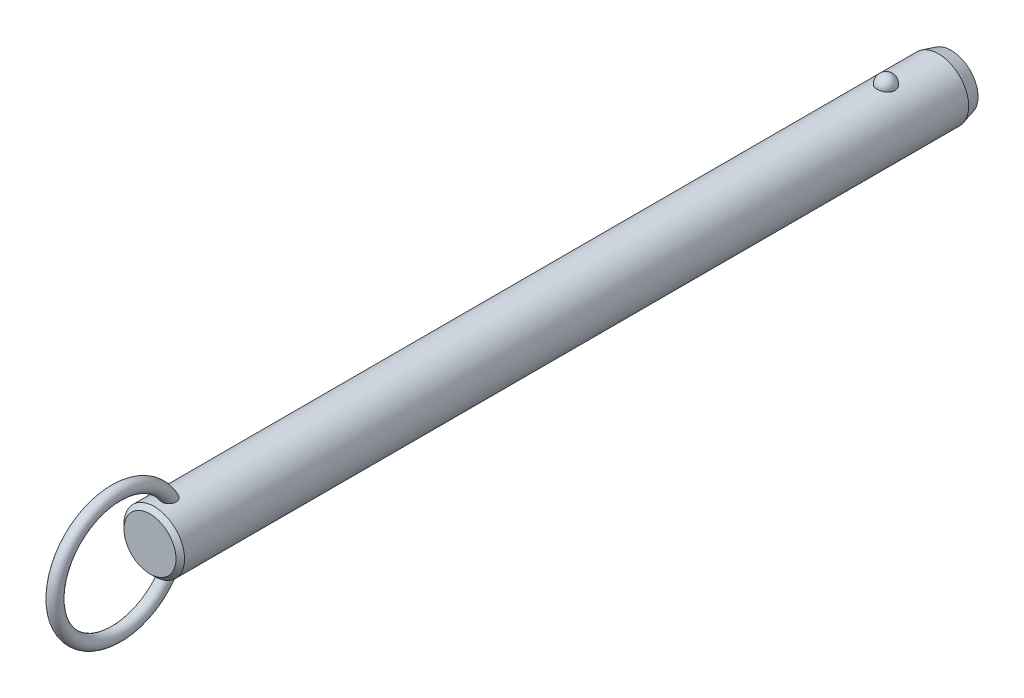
ISO-10303-21;
HEADER;
FILE_DESCRIPTION(('STEP AP214'),'2;1');
FILE_NAME('part.step','',(''),(''),'','','');
FILE_SCHEMA(('AUTOMOTIVE_DESIGN { 1 0 10303 214 1 1 1 1 }'));
ENDSEC;
DATA;
#1=APPLICATION_CONTEXT('core data for automotive mechanical design processes');
#2=APPLICATION_PROTOCOL_DEFINITION('international standard','automotive_design',2000,#1);
#3=PRODUCT_CONTEXT('',#1,'mechanical');
#4=PRODUCT('Part','Part','',(#3));
#5=PRODUCT_RELATED_PRODUCT_CATEGORY('part','',(#4));
#6=PRODUCT_DEFINITION_FORMATION('','',#4);
#7=PRODUCT_DEFINITION_CONTEXT('part definition',#1,'design');
#8=PRODUCT_DEFINITION('design','',#6,#7);
#9=PRODUCT_DEFINITION_SHAPE('','',#8);
#10=(LENGTH_UNIT() NAMED_UNIT(*) SI_UNIT(.MILLI.,.METRE.));
#11=(NAMED_UNIT(*) PLANE_ANGLE_UNIT() SI_UNIT($,.RADIAN.));
#12=(NAMED_UNIT(*) SI_UNIT($,.STERADIAN.) SOLID_ANGLE_UNIT());
#13=UNCERTAINTY_MEASURE_WITH_UNIT(LENGTH_MEASURE(1.E-05),#10,'distance_accuracy_value','');
#14=(GEOMETRIC_REPRESENTATION_CONTEXT(3) GLOBAL_UNCERTAINTY_ASSIGNED_CONTEXT((#13)) GLOBAL_UNIT_ASSIGNED_CONTEXT((#10,
#11,#12)) REPRESENTATION_CONTEXT('',''));
#15=CARTESIAN_POINT('',(0.,0.,0.));
#16=DIRECTION('',(0.,0.,1.));
#17=DIRECTION('',(1.,0.,0.));
#18=AXIS2_PLACEMENT_3D('',#15,#16,#17);
#19=CARTESIAN_POINT('',(0.,0.,162.6));
#20=DIRECTION('',(0.,0.,-1.));
#21=DIRECTION('',(-1.,0.,0.));
#22=AXIS2_PLACEMENT_3D('',#19,#20,#21);
#23=CYLINDRICAL_SURFACE('',#22,7.1);
#24=CARTESIAN_POINT('',(2.0769088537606,6.78943661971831,-2.1));
#25=CARTESIAN_POINT('',(2.07690739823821,6.78943796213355,-1.98268154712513));
#26=CARTESIAN_POINT('',(2.06738130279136,6.79237331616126,-1.86534506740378));
#27=CARTESIAN_POINT('',(2.0295040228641,6.8037853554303,-1.63400788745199));
#28=CARTESIAN_POINT('',(2.00114757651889,6.81226358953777,-1.52000812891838));
#29=CARTESIAN_POINT('',(1.92632025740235,6.83379798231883,-1.29863433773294));
#30=CARTESIAN_POINT('',(1.87985726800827,6.84685214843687,-1.19125744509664));
#31=CARTESIAN_POINT('',(1.76995205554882,6.87608091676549,-0.98604657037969));
#32=CARTESIAN_POINT('',(1.70650980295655,6.8922555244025,-0.88821260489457));
#33=CARTESIAN_POINT('',(1.5638119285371,6.92602930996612,-0.704242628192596));
#34=CARTESIAN_POINT('',(1.4844714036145,6.94363582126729,-0.618173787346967));
#35=CARTESIAN_POINT('',(1.31221746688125,6.97823658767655,-0.460740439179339));
#36=CARTESIAN_POINT('',(1.21930409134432,6.99523084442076,-0.389375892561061));
#37=CARTESIAN_POINT('',(1.02268781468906,7.02666176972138,-0.263547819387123));
#38=CARTESIAN_POINT('',(0.91902009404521,7.04110638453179,-0.209031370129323));
#39=CARTESIAN_POINT('',(0.703548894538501,7.06588726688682,-0.118163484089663));
#40=CARTESIAN_POINT('',(0.591746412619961,7.07622403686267,-0.0818098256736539));
#41=CARTESIAN_POINT('',(0.365557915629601,7.09147068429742,-0.0288711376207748));
#42=CARTESIAN_POINT('',(0.251267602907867,7.09648447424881,-0.0119070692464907));
#43=CARTESIAN_POINT('',(0.0213499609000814,7.10089837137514,0.00304925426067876));
#44=CARTESIAN_POINT('',(-0.0942772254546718,7.10029907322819,0.00104351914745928));
#45=CARTESIAN_POINT('',(-0.321651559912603,7.09360829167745,-0.0216931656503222));
#46=CARTESIAN_POINT('',(-0.433431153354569,7.08760388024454,-0.0421272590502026));
#47=CARTESIAN_POINT('',(-0.651862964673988,7.07086131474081,-0.100729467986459));
#48=CARTESIAN_POINT('',(-0.758515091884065,7.06012307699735,-0.138897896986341));
#49=CARTESIAN_POINT('',(-0.964449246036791,7.03496097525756,-0.232213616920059));
#50=CARTESIAN_POINT('',(-1.06368095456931,7.02051445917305,-0.287465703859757));
#51=CARTESIAN_POINT('',(-1.25145353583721,6.98948740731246,-0.413383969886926));
#52=CARTESIAN_POINT('',(-1.33999321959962,6.97290663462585,-0.48405186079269));
#53=CARTESIAN_POINT('',(-1.50591604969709,6.93898770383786,-0.640594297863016));
#54=CARTESIAN_POINT('',(-1.58302488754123,6.92164094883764,-0.726757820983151));
#55=CARTESIAN_POINT('',(-1.72189320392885,6.8884103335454,-0.91092752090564));
#56=CARTESIAN_POINT('',(-1.78365144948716,6.87252659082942,-1.008934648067));
#57=CARTESIAN_POINT('',(-1.89101272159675,6.84377189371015,-1.21549497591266));
#58=CARTESIAN_POINT('',(-1.93639553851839,6.83094274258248,-1.32416860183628));
#59=CARTESIAN_POINT('',(-2.00874275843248,6.81002070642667,-1.54791500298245));
#60=CARTESIAN_POINT('',(-2.03570774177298,6.80192767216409,-1.66298757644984));
#61=CARTESIAN_POINT('',(-2.07047276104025,6.7914266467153,-1.89571453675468));
#62=CARTESIAN_POINT('',(-2.07835878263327,6.78899315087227,-2.01335491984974));
#63=CARTESIAN_POINT('',(-2.07502083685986,6.79001409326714,-2.24833570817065));
#64=CARTESIAN_POINT('',(-2.06379746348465,6.7934683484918,-2.36567612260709));
#65=CARTESIAN_POINT('',(-2.02263913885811,6.80583442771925,-2.59603194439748));
#66=CARTESIAN_POINT('',(-1.99281127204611,6.81471501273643,-2.70906820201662));
#67=CARTESIAN_POINT('',(-1.91526639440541,6.83691232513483,-2.92836575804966));
#68=CARTESIAN_POINT('',(-1.8675486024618,6.85022924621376,-3.03462676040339));
#69=CARTESIAN_POINT('',(-1.75504492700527,6.87991336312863,-3.23806487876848));
#70=CARTESIAN_POINT('',(-1.69015924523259,6.89629822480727,-3.33518422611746));
#71=CARTESIAN_POINT('',(-1.54505404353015,6.93024852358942,-3.51697105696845));
#72=CARTESIAN_POINT('',(-1.46483385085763,6.94781401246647,-3.60163799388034));
#73=CARTESIAN_POINT('',(-1.29071406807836,6.98225977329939,-3.75654119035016));
#74=CARTESIAN_POINT('',(-1.19675650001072,6.99913673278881,-3.82671308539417));
#75=CARTESIAN_POINT('',(-0.997940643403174,7.03023618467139,-3.9501837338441));
#76=CARTESIAN_POINT('',(-0.89308318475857,7.04445887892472,-4.00348377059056));
#77=CARTESIAN_POINT('',(-0.676902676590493,7.06848365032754,-4.09107242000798));
#78=CARTESIAN_POINT('',(-0.565686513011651,7.0783430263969,-4.12560889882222));
#79=CARTESIAN_POINT('',(-0.338739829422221,7.09282534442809,-4.17575450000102));
#80=CARTESIAN_POINT('',(-0.223009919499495,7.09744899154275,-4.19136617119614));
#81=CARTESIAN_POINT('',(0.00707628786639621,7.10090930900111,-4.20307965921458));
#82=CARTESIAN_POINT('',(0.121410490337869,7.09986531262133,-4.19958377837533));
#83=CARTESIAN_POINT('',(0.347815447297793,7.092380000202,-4.17411564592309));
#84=CARTESIAN_POINT('',(0.459886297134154,7.08593891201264,-4.15214417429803));
#85=CARTESIAN_POINT('',(0.678084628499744,7.06838983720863,-4.09049562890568));
#86=CARTESIAN_POINT('',(0.784237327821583,7.05730369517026,-4.05090137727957));
#87=CARTESIAN_POINT('',(0.988305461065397,7.03163139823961,-3.95511447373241));
#88=CARTESIAN_POINT('',(1.08622031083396,7.01704499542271,-3.89892064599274));
#89=CARTESIAN_POINT('',(1.27284490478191,6.98562668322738,-3.77035541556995));
#90=CARTESIAN_POINT('',(1.36137372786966,6.96876135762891,-3.69772964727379));
#91=CARTESIAN_POINT('',(1.52509486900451,6.93477412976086,-3.53878279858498));
#92=CARTESIAN_POINT('',(1.60028496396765,6.91765218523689,-3.45245943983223));
#93=CARTESIAN_POINT('',(1.73681688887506,6.88465753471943,-3.26658774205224));
#94=CARTESIAN_POINT('',(1.79785966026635,6.86881574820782,-3.16681408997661));
#95=CARTESIAN_POINT('',(1.90265327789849,6.84053157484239,-2.95814408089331));
#96=CARTESIAN_POINT('',(1.94640861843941,6.82808830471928,-2.84925010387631));
#97=CARTESIAN_POINT('',(2.01274378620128,6.80881460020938,-2.63454318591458));
#98=CARTESIAN_POINT('',(2.03676193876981,6.80160856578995,-2.52920574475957));
#99=CARTESIAN_POINT('',(2.06884490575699,6.79191902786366,-2.3159172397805));
#100=CARTESIAN_POINT('',(2.07691019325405,6.78943538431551,-2.20796625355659));
#101=CARTESIAN_POINT('',(2.0769088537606,6.78943661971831,-2.1));
#102=B_SPLINE_CURVE_WITH_KNOTS('',3,(#24,#25,#26,#27,#28,#29,#30,#31,#32,#33,#34,#35,#36,#37,
#38,#39,#40,#41,#42,#43,#44,#45,#46,#47,#48,#49,#50,#51,#52,#53,#54,#55,#56,#57,#58,#59,#60,#61,
#62,#63,#64,#65,#66,#67,#68,#69,#70,#71,#72,#73,#74,#75,#76,#77,#78,#79,#80,#81,#82,#83,#84,#85,
#86,#87,#88,#89,#90,#91,#92,#93,#94,#95,#96,#97,#98,#99,#100,#101),.UNSPECIFIED.,.T.,.F.,(4,2,2,
2,2,2,2,2,2,2,2,2,2,2,2,2,2,2,2,2,2,2,2,2,2,2,2,2,2,2,2,2,2,2,2,2,2,2,4),(0.,0.351568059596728,
0.703234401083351,1.05474780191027,1.40626181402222,1.75970563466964,2.11314851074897,
2.4654696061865,2.81774759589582,3.16301449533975,3.50824481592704,3.84801136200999,
4.18778391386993,4.52968352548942,4.87162112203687,5.22076181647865,5.56993054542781,
5.92363364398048,6.27732559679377,6.62942052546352,6.98150450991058,7.33158042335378,
7.68167162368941,8.03384443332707,8.38603269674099,8.73975272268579,9.09344583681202,
9.44234545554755,9.79119807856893,10.1327344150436,10.4742563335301,10.8141898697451,
11.1541474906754,11.4997793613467,11.8454687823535,12.1979079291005,12.5502553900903,
12.8738073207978,13.1973496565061),.UNSPECIFIED.);
#103=CARTESIAN_POINT('',(2.0769088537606,6.78943661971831,-2.1));
#104=VERTEX_POINT('',#103);
#105=EDGE_CURVE('E41',#104,#104,#102,.T.);
#106=ORIENTED_EDGE('',*,*,#105,.T.);
#107=EDGE_LOOP('',(#106));
#108=FACE_BOUND('',#107,.T.);
#109=CARTESIAN_POINT('',(0.,0.,169.52));
#110=DIRECTION('',(0.,0.,1.));
#111=DIRECTION('',(1.,0.,0.));
#112=AXIS2_PLACEMENT_3D('',#109,#110,#111);
#113=CIRCLE('',#112,7.1);
#114=CARTESIAN_POINT('',(7.1,0.,169.52));
#115=VERTEX_POINT('',#114);
#116=EDGE_CURVE('E10',#115,#115,#113,.F.);
#117=ORIENTED_EDGE('',*,*,#116,.T.);
#118=EDGE_LOOP('',(#117));
#119=FACE_BOUND('',#118,.T.);
#120=CARTESIAN_POINT('',(-0.429539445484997,-7.08699541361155,164.342921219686));
#121=CARTESIAN_POINT('',(-0.508331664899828,-7.08221999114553,164.366876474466));
#122=CARTESIAN_POINT('',(-0.585039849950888,-7.07624016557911,164.397457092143));
#123=CARTESIAN_POINT('',(-0.73208265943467,-7.06254296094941,164.471024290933));
#124=CARTESIAN_POINT('',(-0.802417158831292,-7.05482554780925,164.514011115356));
#125=CARTESIAN_POINT('',(-0.934722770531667,-7.03851844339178,164.611113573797));
#126=CARTESIAN_POINT('',(-0.996700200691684,-7.02992941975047,164.665220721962));
#127=CARTESIAN_POINT('',(-1.11079942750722,-7.01280697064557,164.782967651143));
#128=CARTESIAN_POINT('',(-1.16292136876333,-7.00427354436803,164.846607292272));
#129=CARTESIAN_POINT('',(-1.25705660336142,-6.98799959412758,164.982687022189));
#130=CARTESIAN_POINT('',(-1.29888032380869,-6.98027525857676,165.055259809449));
#131=CARTESIAN_POINT('',(-1.37069920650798,-6.96652886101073,165.206168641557));
#132=CARTESIAN_POINT('',(-1.40069157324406,-6.96050720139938,165.284506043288));
#133=CARTESIAN_POINT('',(-1.45043507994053,-6.95031881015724,165.450190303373));
#134=CARTESIAN_POINT('',(-1.46937115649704,-6.94630231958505,165.537789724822));
#135=CARTESIAN_POINT('',(-1.49424917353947,-6.94099239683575,165.714871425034));
#136=CARTESIAN_POINT('',(-1.50018601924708,-6.93970003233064,165.804354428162));
#137=CARTESIAN_POINT('',(-1.49978214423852,-6.93978815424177,165.994060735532));
#138=CARTESIAN_POINT('',(-1.49187639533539,-6.94150934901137,166.094279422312));
#139=CARTESIAN_POINT('',(-1.46177925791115,-6.94790814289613,166.292479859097));
#140=CARTESIAN_POINT('',(-1.43957541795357,-6.95258831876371,166.390459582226));
#141=CARTESIAN_POINT('',(-1.37783293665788,-6.96510647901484,166.59536292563));
#142=CARTESIAN_POINT('',(-1.33634073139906,-6.97328848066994,166.701680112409));
#143=CARTESIAN_POINT('',(-1.23686994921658,-6.99161706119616,166.906177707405));
#144=CARTESIAN_POINT('',(-1.17889192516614,-7.00176357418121,167.004358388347));
#145=CARTESIAN_POINT('',(-1.05875124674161,-7.02082898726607,167.172374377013));
#146=CARTESIAN_POINT('',(-0.999247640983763,-7.02963746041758,167.244123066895));
#147=CARTESIAN_POINT('',(-0.869494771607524,-7.04686074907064,167.377195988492));
#148=CARTESIAN_POINT('',(-0.799263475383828,-7.05527619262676,167.438537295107));
#149=CARTESIAN_POINT('',(-0.665408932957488,-7.06899457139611,167.535131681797));
#150=CARTESIAN_POINT('',(-0.603817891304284,-7.07457275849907,167.573151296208));
#151=CARTESIAN_POINT('',(-0.475172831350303,-7.08437420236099,167.638758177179));
#152=CARTESIAN_POINT('',(-0.408123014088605,-7.08859848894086,167.666353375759));
#153=CARTESIAN_POINT('',(-0.269431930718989,-7.09522749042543,167.709256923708));
#154=CARTESIAN_POINT('',(-0.197757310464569,-7.09761688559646,167.724461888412));
#155=CARTESIAN_POINT('',(-0.0527849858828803,-7.10017268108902,167.740716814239));
#156=CARTESIAN_POINT('',(0.0205115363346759,-7.10034065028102,167.741776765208));
#157=CARTESIAN_POINT('',(0.156426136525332,-7.09855986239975,167.730461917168));
#158=CARTESIAN_POINT('',(0.219199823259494,-7.09688191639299,167.719806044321));
#159=CARTESIAN_POINT('',(0.342134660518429,-7.09201880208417,167.688537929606));
#160=CARTESIAN_POINT('',(0.402295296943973,-7.08883333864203,167.667923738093));
#161=CARTESIAN_POINT('',(0.520687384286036,-7.08113868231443,167.617212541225));
#162=CARTESIAN_POINT('',(0.578791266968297,-7.07658958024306,167.586827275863));
#163=CARTESIAN_POINT('',(0.690173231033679,-7.06659708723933,167.518367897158));
#164=CARTESIAN_POINT('',(0.743447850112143,-7.061153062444,167.480288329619));
#165=CARTESIAN_POINT('',(0.870947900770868,-7.04680292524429,167.376592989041));
#166=CARTESIAN_POINT('',(0.941828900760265,-7.03755800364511,167.306897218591));
#167=CARTESIAN_POINT('',(1.07136606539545,-7.01900793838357,167.156945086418));
#168=CARTESIAN_POINT('',(1.13000013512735,-7.00970271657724,167.076670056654));
#169=CARTESIAN_POINT('',(1.23579584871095,-6.99183327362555,166.906899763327));
#170=CARTESIAN_POINT('',(1.28274271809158,-6.98328455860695,166.817269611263));
#171=CARTESIAN_POINT('',(1.36351442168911,-6.96796352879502,166.632176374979));
#172=CARTESIAN_POINT('',(1.39733971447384,-6.96119115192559,166.536713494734));
#173=CARTESIAN_POINT('',(1.45579181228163,-6.94922464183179,166.32530928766));
#174=CARTESIAN_POINT('',(1.47790145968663,-6.94449000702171,166.208631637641));
#175=CARTESIAN_POINT('',(1.50168752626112,-6.93938731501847,165.973015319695));
#176=CARTESIAN_POINT('',(1.50336085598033,-6.93901991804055,165.85407631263));
#177=CARTESIAN_POINT('',(1.48486516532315,-6.9430010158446,165.62360799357));
#178=CARTESIAN_POINT('',(1.46573441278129,-6.9471253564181,165.511995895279));
#179=CARTESIAN_POINT('',(1.40606892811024,-6.95944667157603,165.294886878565));
#180=CARTESIAN_POINT('',(1.36556446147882,-6.96763788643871,165.1893815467));
#181=CARTESIAN_POINT('',(1.2708270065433,-6.98548038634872,165.004287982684));
#182=CARTESIAN_POINT('',(1.21949810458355,-6.99473841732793,164.923171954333));
#183=CARTESIAN_POINT('',(1.10242050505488,-7.01414069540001,164.772227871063));
#184=CARTESIAN_POINT('',(1.03668119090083,-7.02428436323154,164.70239252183));
#185=CARTESIAN_POINT('',(0.900559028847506,-7.04295285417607,164.583573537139));
#186=CARTESIAN_POINT('',(0.831428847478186,-7.05153466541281,164.533157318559));
#187=CARTESIAN_POINT('',(0.685291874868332,-7.06723150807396,164.445142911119));
#188=CARTESIAN_POINT('',(0.608287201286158,-7.07434693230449,164.407541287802));
#189=CARTESIAN_POINT('',(0.451878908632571,-7.08602232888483,164.347491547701));
#190=CARTESIAN_POINT('',(0.372686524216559,-7.09067127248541,164.324508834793));
#191=CARTESIAN_POINT('',(0.21147739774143,-7.09730788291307,164.292035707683));
#192=CARTESIAN_POINT('',(0.129460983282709,-7.09929585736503,164.28254373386));
#193=CARTESIAN_POINT('',(-0.0332905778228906,-7.10037858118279,164.277351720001));
#194=CARTESIAN_POINT('',(-0.114016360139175,-7.09953334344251,164.281365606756));
#195=CARTESIAN_POINT('',(-0.273670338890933,-7.09517338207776,164.302454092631));
#196=CARTESIAN_POINT('',(-0.352598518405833,-7.09165863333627,164.319528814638));
#197=CARTESIAN_POINT('',(-0.429539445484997,-7.08699541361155,164.342921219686));
#198=B_SPLINE_CURVE_WITH_KNOTS('',3,(#120,#121,#122,#123,#124,#125,#126,#127,#128,#129,#130,
#131,#132,#133,#134,#135,#136,#137,#138,#139,#140,#141,#142,#143,#144,#145,#146,#147,#148,#149,
#150,#151,#152,#153,#154,#155,#156,#157,#158,#159,#160,#161,#162,#163,#164,#165,#166,#167,#168,
#169,#170,#171,#172,#173,#174,#175,#176,#177,#178,#179,#180,#181,#182,#183,#184,#185,#186,#187,
#188,#189,#190,#191,#192,#193,#194,#195,#196,#197),.UNSPECIFIED.,.T.,.F.,(4,2,2,2,2,2,2,2,2,2,2,
2,2,2,2,2,2,2,2,2,2,2,2,2,2,2,2,2,2,2,2,2,2,2,2,2,2,2,4),(0.,0.247183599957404,
0.494372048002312,0.741372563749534,0.988369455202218,1.23962059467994,1.490931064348,
1.75897818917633,2.02713035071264,2.3275826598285,2.62829697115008,2.97008736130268,
3.31186629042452,3.59175319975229,3.87117637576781,4.08813841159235,4.30493502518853,
4.5235225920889,4.74195577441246,4.93215328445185,5.12238804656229,5.31884850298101,
5.51544871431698,5.81332317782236,6.11173048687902,6.41527266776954,6.71880423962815,
7.07358156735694,7.42841252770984,7.76631485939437,8.10373999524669,8.39142246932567,
8.67891817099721,8.93560332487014,9.19221962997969,9.43881106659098,9.68537399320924,
9.92674752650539,10.1681233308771),.UNSPECIFIED.);
#199=CARTESIAN_POINT('',(-0.429539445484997,-7.08699541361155,164.342921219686));
#200=VERTEX_POINT('',#199);
#201=EDGE_CURVE('E59',#200,#200,#198,.T.);
#202=ORIENTED_EDGE('',*,*,#201,.T.);
#203=EDGE_LOOP('',(#202));
#204=FACE_BOUND('',#203,.T.);
#205=CARTESIAN_POINT('',(-0.429539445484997,7.08699541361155,164.342921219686));
#206=CARTESIAN_POINT('',(-0.35166550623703,7.09171429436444,164.319246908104));
#207=CARTESIAN_POINT('',(-0.271733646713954,7.09525896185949,164.302036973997));
#208=CARTESIAN_POINT('',(-0.110026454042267,7.09960839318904,164.281005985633));
#209=CARTESIAN_POINT('',(-0.0282502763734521,7.10041187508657,164.277191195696));
#210=CARTESIAN_POINT('',(0.134782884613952,7.09918849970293,164.283059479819));
#211=CARTESIAN_POINT('',(0.216039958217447,7.09716214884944,164.29274013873));
#212=CARTESIAN_POINT('',(0.375730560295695,7.09050177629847,164.325347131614));
#213=CARTESIAN_POINT('',(0.454164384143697,7.08586802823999,164.348272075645));
#214=CARTESIAN_POINT('',(0.606025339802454,7.07449911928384,164.406771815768));
#215=CARTESIAN_POINT('',(0.67945100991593,7.06776334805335,164.442350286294));
#216=CARTESIAN_POINT('',(0.819234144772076,7.05292866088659,164.525175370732));
#217=CARTESIAN_POINT('',(0.88559181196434,7.04482978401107,164.572421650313));
#218=CARTESIAN_POINT('',(1.00993211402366,7.02808709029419,164.677590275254));
#219=CARTESIAN_POINT('',(1.06785399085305,7.01943990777,164.735583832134));
#220=CARTESIAN_POINT('',(1.17342527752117,7.00256662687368,164.860301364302));
#221=CARTESIAN_POINT('',(1.22107408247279,6.99434055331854,164.927025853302));
#222=CARTESIAN_POINT('',(1.30652927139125,6.97889183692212,165.069362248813));
#223=CARTESIAN_POINT('',(1.34399711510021,6.97170674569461,165.145180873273));
#224=CARTESIAN_POINT('',(1.40682616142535,6.95930080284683,165.301810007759));
#225=CARTESIAN_POINT('',(1.43218374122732,6.95408053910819,165.38262200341));
#226=CARTESIAN_POINT('',(1.47246409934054,6.94566853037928,165.553531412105));
#227=CARTESIAN_POINT('',(1.48642590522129,6.9426653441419,165.64386307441));
#228=CARTESIAN_POINT('',(1.5011410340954,6.93949744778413,165.825619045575));
#229=CARTESIAN_POINT('',(1.50188917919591,6.93933385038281,165.917043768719));
#230=CARTESIAN_POINT('',(1.49030464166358,6.94183245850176,166.11084381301));
#231=CARTESIAN_POINT('',(1.47627413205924,6.94486147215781,166.213112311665));
#232=CARTESIAN_POINT('',(1.43356351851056,6.95380194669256,166.414471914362));
#233=CARTESIAN_POINT('',(1.4048676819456,6.95971650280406,166.513559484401));
#234=CARTESIAN_POINT('',(1.32908750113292,6.97461208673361,166.718908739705));
#235=CARTESIAN_POINT('',(1.28011435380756,6.98388945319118,166.824456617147));
#236=CARTESIAN_POINT('',(1.16520357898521,7.00397743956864,167.025760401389));
#237=CARTESIAN_POINT('',(1.09927694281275,7.01478706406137,167.121522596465));
#238=CARTESIAN_POINT('',(0.969361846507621,7.03373936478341,167.276756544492));
#239=CARTESIAN_POINT('',(0.909042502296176,7.04187023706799,167.339303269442));
#240=CARTESIAN_POINT('',(0.779178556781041,7.05741732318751,167.454053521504));
#241=CARTESIAN_POINT('',(0.709649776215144,7.06483472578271,167.506274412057));
#242=CARTESIAN_POINT('',(0.576854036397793,7.0767751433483,167.588113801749));
#243=CARTESIAN_POINT('',(0.515118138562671,7.08158033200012,167.620164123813));
#244=CARTESIAN_POINT('',(0.387127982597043,7.08972701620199,167.673765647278));
#245=CARTESIAN_POINT('',(0.320877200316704,7.09306962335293,167.695324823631));
#246=CARTESIAN_POINT('',(0.185041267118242,7.09791507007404,167.726400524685));
#247=CARTESIAN_POINT('',(0.115437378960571,7.09940591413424,167.735838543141));
#248=CARTESIAN_POINT('',(-0.0243157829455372,7.10030171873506,167.741522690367));
#249=CARTESIAN_POINT('',(-0.094464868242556,7.0997073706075,167.737773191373));
#250=CARTESIAN_POINT('',(-0.225713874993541,7.09668414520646,167.718508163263));
#251=CARTESIAN_POINT('',(-0.287006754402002,7.09444865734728,167.704232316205));
#252=CARTESIAN_POINT('',(-0.406555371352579,7.08860360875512,167.666368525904));
#253=CARTESIAN_POINT('',(-0.464809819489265,7.08499346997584,167.642776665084));
#254=CARTESIAN_POINT('',(-0.594955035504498,7.07541654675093,167.578923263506));
#255=CARTESIAN_POINT('',(-0.665389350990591,7.06906574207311,167.535753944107));
#256=CARTESIAN_POINT('',(-0.798242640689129,7.05530261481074,167.438587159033));
#257=CARTESIAN_POINT('',(-0.860645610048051,7.0478882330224,167.384568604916));
#258=CARTESIAN_POINT('',(-0.994249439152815,7.03045217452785,167.250996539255));
#259=CARTESIAN_POINT('',(-1.06260129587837,7.02030745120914,167.168614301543));
#260=CARTESIAN_POINT('',(-1.18502045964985,7.00068382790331,166.993843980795));
#261=CARTESIAN_POINT('',(-1.23907684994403,6.99120544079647,166.901448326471));
#262=CARTESIAN_POINT('',(-1.33335589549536,6.97384343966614,166.708008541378));
#263=CARTESIAN_POINT('',(-1.37336138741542,6.96598557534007,166.606856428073));
#264=CARTESIAN_POINT('',(-1.43770677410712,6.95299053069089,166.399504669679));
#265=CARTESIAN_POINT('',(-1.46204473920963,6.94785368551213,166.29330440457));
#266=CARTESIAN_POINT('',(-1.49537533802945,6.94076296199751,166.068231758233));
#267=CARTESIAN_POINT('',(-1.50273564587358,6.93914842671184,165.94909751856));
#268=CARTESIAN_POINT('',(-1.4954555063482,6.94072368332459,165.711470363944));
#269=CARTESIAN_POINT('',(-1.48082914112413,6.94391040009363,165.592977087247));
#270=CARTESIAN_POINT('',(-1.43076401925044,6.95438579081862,165.373432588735));
#271=CARTESIAN_POINT('',(-1.3976222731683,6.96121852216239,165.271841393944));
#272=CARTESIAN_POINT('',(-1.31211274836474,6.97783941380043,165.077351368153));
#273=CARTESIAN_POINT('',(-1.25976607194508,6.98762432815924,164.98444313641));
#274=CARTESIAN_POINT('',(-1.14583073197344,7.00713153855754,164.824160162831));
#275=CARTESIAN_POINT('',(-1.08665947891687,7.01665982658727,164.755035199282));
#276=CARTESIAN_POINT('',(-0.956606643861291,7.03556646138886,164.628878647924));
#277=CARTESIAN_POINT('',(-0.885737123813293,7.04494495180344,164.571834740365));
#278=CARTESIAN_POINT('',(-0.7515580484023,7.06035735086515,164.483100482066));
#279=CARTESIAN_POINT('',(-0.690120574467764,7.0666695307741,164.448593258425));
#280=CARTESIAN_POINT('',(-0.562815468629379,7.07794609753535,164.388750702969));
#281=CARTESIAN_POINT('',(-0.496948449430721,7.08291067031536,164.363414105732));
#282=CARTESIAN_POINT('',(-0.429539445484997,7.08699541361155,164.342921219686));
#283=B_SPLINE_CURVE_WITH_KNOTS('',3,(#205,#206,#207,#208,#209,#210,#211,#212,#213,#214,#215,
#216,#217,#218,#219,#220,#221,#222,#223,#224,#225,#226,#227,#228,#229,#230,#231,#232,#233,#234,
#235,#236,#237,#238,#239,#240,#241,#242,#243,#244,#245,#246,#247,#248,#249,#250,#251,#252,#253,
#254,#255,#256,#257,#258,#259,#260,#261,#262,#263,#264,#265,#266,#267,#268,#269,#270,#271,#272,
#273,#274,#275,#276,#277,#278,#279,#280,#281,#282),.UNSPECIFIED.,.T.,.F.,(4,2,2,2,2,2,2,2,2,2,2,
2,2,2,2,2,2,2,2,2,2,2,2,2,2,2,2,2,2,2,2,2,2,2,2,2,2,2,4),(0.,0.244335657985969,
0.488785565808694,0.733191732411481,0.977572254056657,1.2220237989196,1.46646834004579,
1.71259457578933,1.9587352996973,2.21226768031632,2.46587585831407,2.73913816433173,
3.01250754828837,3.32109936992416,3.63002293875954,3.9786351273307,4.32702187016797,
4.58793945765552,4.84841449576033,5.05676704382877,5.26496096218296,5.47449661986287,
5.68396281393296,5.87205447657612,6.06022532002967,6.30743751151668,6.55513496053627,
6.87602468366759,7.19715875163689,7.5230577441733,7.84899686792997,8.2051615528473,
8.56109821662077,8.88040084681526,9.19935367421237,9.47236282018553,9.74509220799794,
9.95662250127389,10.1681235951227),.UNSPECIFIED.);
#284=CARTESIAN_POINT('',(-0.429539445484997,7.08699541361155,164.342921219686));
#285=VERTEX_POINT('',#284);
#286=EDGE_CURVE('E67',#285,#285,#283,.T.);
#287=ORIENTED_EDGE('',*,*,#286,.T.);
#288=EDGE_LOOP('',(#287));
#289=FACE_BOUND('',#288,.T.);
#290=CARTESIAN_POINT('',(0.,0.,-14.3999999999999));
#291=DIRECTION('',(0.,0.,-1.));
#292=DIRECTION('',(-1.,0.,0.));
#293=AXIS2_PLACEMENT_3D('',#290,#291,#292);
#294=CIRCLE('',#293,7.1);
#295=CARTESIAN_POINT('',(-7.1,0.,-14.3999999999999));
#296=VERTEX_POINT('',#295);
#297=EDGE_CURVE('E56',#296,#296,#294,.F.);
#298=ORIENTED_EDGE('',*,*,#297,.T.);
#299=EDGE_LOOP('',(#298));
#300=FACE_BOUND('',#299,.T.);
#301=ADVANCED_FACE('F37',(#108,#119,#204,#289,#300),#23,.T.);
#302=CARTESIAN_POINT('',(0.,0.,-17.4));
#303=DIRECTION('',(0.,0.,-1.));
#304=DIRECTION('',(-1.,0.,0.));
#305=AXIS2_PLACEMENT_3D('',#302,#303,#304);
#306=PLANE('',#305);
#307=CARTESIAN_POINT('',(0.,0.,-17.4));
#308=DIRECTION('',(0.,0.,-1.));
#309=DIRECTION('',(-1.,0.,0.));
#310=AXIS2_PLACEMENT_3D('',#307,#308,#309);
#311=CIRCLE('',#310,6.29615242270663);
#312=CARTESIAN_POINT('',(-6.29615242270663,0.,-17.4));
#313=VERTEX_POINT('',#312);
#314=EDGE_CURVE('E66',#313,#313,#311,.T.);
#315=ORIENTED_EDGE('',*,*,#314,.T.);
#316=EDGE_LOOP('',(#315));
#317=FACE_BOUND('',#316,.T.);
#318=ADVANCED_FACE('F85',(#317),#306,.T.);
#319=CARTESIAN_POINT('',(0.,0.,-17.4));
#320=DIRECTION('',(0.,0.,1.));
#321=DIRECTION('',(1.,0.,0.));
#322=AXIS2_PLACEMENT_3D('',#319,#320,#321);
#323=CONICAL_SURFACE('',#322,6.29615242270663,0.261799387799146);
#324=ORIENTED_EDGE('',*,*,#297,.F.);
#325=EDGE_LOOP('',(#324));
#326=FACE_BOUND('',#325,.T.);
#327=ORIENTED_EDGE('',*,*,#314,.F.);
#328=EDGE_LOOP('',(#327));
#329=FACE_BOUND('',#328,.T.);
#330=ADVANCED_FACE('F83',(#326,#329),#323,.T.);
#331=CARTESIAN_POINT('',(0.,0.,170.52));
#332=DIRECTION('',(0.,0.,1.));
#333=DIRECTION('',(1.,0.,0.));
#334=AXIS2_PLACEMENT_3D('',#331,#332,#333);
#335=PLANE('',#334);
#336=CARTESIAN_POINT('',(0.,0.,170.52));
#337=DIRECTION('',(0.,0.,1.));
#338=DIRECTION('',(1.,0.,0.));
#339=AXIS2_PLACEMENT_3D('',#336,#337,#338);
#340=CIRCLE('',#339,6.09999999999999);
#341=CARTESIAN_POINT('',(6.09999999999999,0.,170.52));
#342=VERTEX_POINT('',#341);
#343=EDGE_CURVE('E50',#342,#342,#340,.T.);
#344=ORIENTED_EDGE('',*,*,#343,.T.);
#345=EDGE_LOOP('',(#344));
#346=FACE_BOUND('',#345,.T.);
#347=ADVANCED_FACE('F77',(#346),#335,.T.);
#348=CARTESIAN_POINT('',(0.,0.,178.45));
#349=DIRECTION('',(1.,0.,0.));
#350=DIRECTION('',(0.,0.,-1.));
#351=AXIS2_PLACEMENT_3D('',#348,#349,#350);
#352=TOROIDAL_SURFACE('',#351,14.35,1.5);
#353=ORIENTED_EDGE('',*,*,#286,.F.);
#354=EDGE_LOOP('',(#353));
#355=FACE_BOUND('',#354,.T.);
#356=ORIENTED_EDGE('',*,*,#201,.F.);
#357=EDGE_LOOP('',(#356));
#358=FACE_BOUND('',#357,.T.);
#359=ADVANCED_FACE('F73',(#355,#358),#352,.T.);
#360=CARTESIAN_POINT('',(0.,0.,170.52));
#361=DIRECTION('',(0.,0.,-1.));
#362=DIRECTION('',(-1.,0.,0.));
#363=AXIS2_PLACEMENT_3D('',#360,#361,#362);
#364=CONICAL_SURFACE('',#363,6.09999999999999,0.78539816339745);
#365=ORIENTED_EDGE('',*,*,#116,.F.);
#366=EDGE_LOOP('',(#365));
#367=FACE_BOUND('',#366,.T.);
#368=ORIENTED_EDGE('',*,*,#343,.F.);
#369=EDGE_LOOP('',(#368));
#370=FACE_BOUND('',#369,.T.);
#371=ADVANCED_FACE('F39',(#367,#370),#364,.T.);
#372=CARTESIAN_POINT('',(0.,7.1,-2.1));
#373=DIRECTION('',(0.,1.,0.));
#374=DIRECTION('',(0.,0.,1.));
#375=AXIS2_PLACEMENT_3D('',#372,#373,#374);
#376=SPHERICAL_SURFACE('',#375,2.10000000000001);
#377=ORIENTED_EDGE('',*,*,#105,.F.);
#378=EDGE_LOOP('',(#377));
#379=FACE_BOUND('',#378,.T.);
#380=ADVANCED_FACE('F79',(#379),#376,.T.);
#381=CLOSED_SHELL('',(#301,#318,#330,#347,#359,#371,#380));
#382=MANIFOLD_SOLID_BREP('B2',#381);
#383=ADVANCED_BREP_SHAPE_REPRESENTATION('',(#18,#382),#14);
#384=SHAPE_DEFINITION_REPRESENTATION(#9,#383);
ENDSEC;
END-ISO-10303-21;
